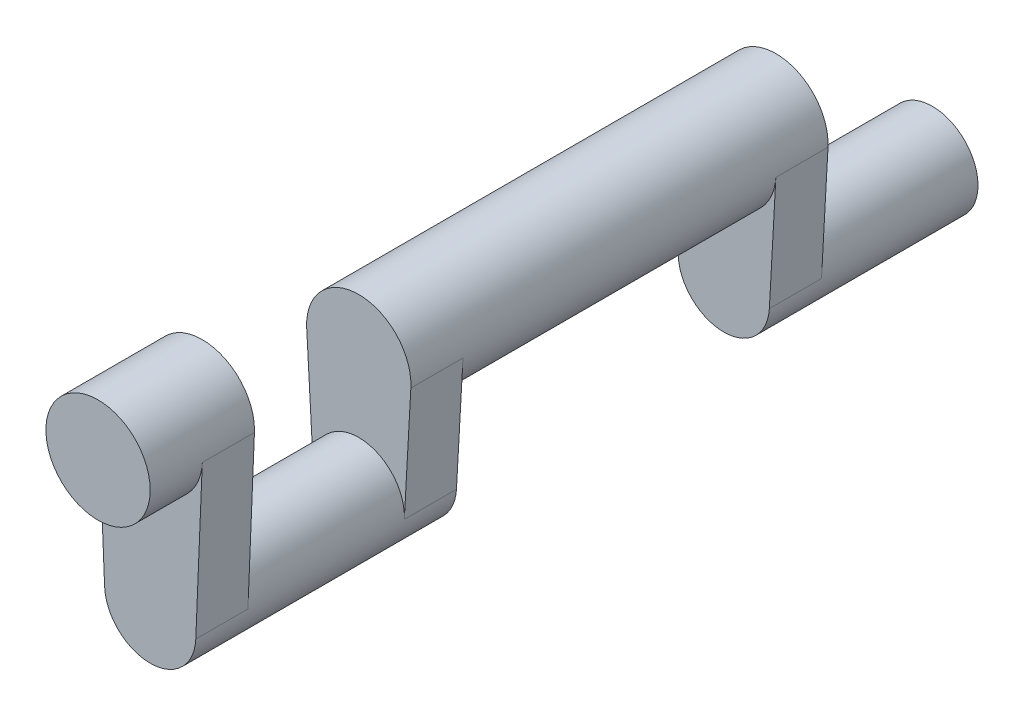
ISO-10303-21;
HEADER;
FILE_DESCRIPTION(('STEP AP214'),'2;1');
FILE_NAME('part.step','',(''),(''),'','','');
FILE_SCHEMA(('AUTOMOTIVE_DESIGN { 1 0 10303 214 1 1 1 1 }'));
ENDSEC;
DATA;
#1=APPLICATION_CONTEXT('core data for automotive mechanical design processes');
#2=APPLICATION_PROTOCOL_DEFINITION('international standard','automotive_design',2000,#1);
#3=PRODUCT_CONTEXT('',#1,'mechanical');
#4=PRODUCT('Part','Part','',(#3));
#5=PRODUCT_RELATED_PRODUCT_CATEGORY('part','',(#4));
#6=PRODUCT_DEFINITION_FORMATION('','',#4);
#7=PRODUCT_DEFINITION_CONTEXT('part definition',#1,'design');
#8=PRODUCT_DEFINITION('design','',#6,#7);
#9=PRODUCT_DEFINITION_SHAPE('','',#8);
#10=(LENGTH_UNIT() NAMED_UNIT(*) SI_UNIT(.MILLI.,.METRE.));
#11=(NAMED_UNIT(*) PLANE_ANGLE_UNIT() SI_UNIT($,.RADIAN.));
#12=(NAMED_UNIT(*) SI_UNIT($,.STERADIAN.) SOLID_ANGLE_UNIT());
#13=UNCERTAINTY_MEASURE_WITH_UNIT(LENGTH_MEASURE(1.E-05),#10,'distance_accuracy_value','');
#14=(GEOMETRIC_REPRESENTATION_CONTEXT(3) GLOBAL_UNCERTAINTY_ASSIGNED_CONTEXT((#13)) GLOBAL_UNIT_ASSIGNED_CONTEXT((#10,
#11,#12)) REPRESENTATION_CONTEXT('',''));
#15=CARTESIAN_POINT('',(0.,0.,0.));
#16=DIRECTION('',(0.,0.,1.));
#17=DIRECTION('',(1.,0.,0.));
#18=AXIS2_PLACEMENT_3D('',#15,#16,#17);
#19=CARTESIAN_POINT('',(0.,-76.2,-152.4));
#20=DIRECTION('',(0.,0.,-1.));
#21=DIRECTION('',(-1.,0.,0.));
#22=AXIS2_PLACEMENT_3D('',#19,#20,#21);
#23=PLANE('',#22);
#24=DIRECTION('',(-0.0555555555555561,0.998455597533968,0.));
#25=VECTOR('',#24,1.);
#26=CARTESIAN_POINT('',(-25.3607721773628,-20.4611111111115,-152.4));
#27=LINE('',#26,#25);
#28=CARTESIAN_POINT('',(-22.1906756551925,-77.4347222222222,-152.4));
#29=VERTEX_POINT('',#28);
#30=CARTESIAN_POINT('',(-25.3607721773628,-20.4611111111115,-152.4));
#31=VERTEX_POINT('',#30);
#32=EDGE_CURVE('E313',#29,#31,#27,.T.);
#33=ORIENTED_EDGE('',*,*,#32,.T.);
#34=CARTESIAN_POINT('',(0.,-19.0500000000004,-152.4));
#35=DIRECTION('',(0.,0.,-1.));
#36=DIRECTION('',(-1.,0.,0.));
#37=AXIS2_PLACEMENT_3D('',#34,#35,#36);
#38=CIRCLE('',#37,25.4000000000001);
#39=CARTESIAN_POINT('',(25.3607721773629,-20.4611111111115,-152.4));
#40=VERTEX_POINT('',#39);
#41=EDGE_CURVE('E156',#31,#40,#38,.F.);
#42=ORIENTED_EDGE('',*,*,#41,.T.);
#43=DIRECTION('',(-0.0555555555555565,-0.998455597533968,0.));
#44=VECTOR('',#43,1.);
#45=CARTESIAN_POINT('',(22.1906756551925,-77.4347222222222,-152.4));
#46=LINE('',#45,#44);
#47=CARTESIAN_POINT('',(22.1906756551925,-77.4347222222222,-152.4));
#48=VERTEX_POINT('',#47);
#49=EDGE_CURVE('E178',#40,#48,#46,.T.);
#50=ORIENTED_EDGE('',*,*,#49,.T.);
#51=CARTESIAN_POINT('',(0.,-76.2,-152.4));
#52=DIRECTION('',(0.,0.,-1.));
#53=DIRECTION('',(-1.,0.,0.));
#54=AXIS2_PLACEMENT_3D('',#51,#52,#53);
#55=CIRCLE('',#54,22.225);
#56=EDGE_CURVE('E184',#48,#29,#55,.T.);
#57=ORIENTED_EDGE('',*,*,#56,.T.);
#58=EDGE_LOOP('',(#33,#42,#50,#57));
#59=FACE_BOUND('',#58,.T.);
#60=ADVANCED_FACE('F31',(#59),#23,.T.);
#61=CARTESIAN_POINT('',(0.,0.,-25.4));
#62=DIRECTION('',(0.,0.,1.));
#63=DIRECTION('',(1.,0.,0.));
#64=AXIS2_PLACEMENT_3D('',#61,#62,#63);
#65=CYLINDRICAL_SURFACE('',#64,25.4);
#66=CARTESIAN_POINT('',(0.,0.,-25.4));
#67=DIRECTION('',(0.,0.,1.));
#68=DIRECTION('',(1.,0.,0.));
#69=AXIS2_PLACEMENT_3D('',#66,#67,#68);
#70=CIRCLE('',#69,25.4);
#71=CARTESIAN_POINT('',(-25.3779418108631,-1.05833333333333,-25.4));
#72=VERTEX_POINT('',#71);
#73=CARTESIAN_POINT('',(25.3779418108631,-1.05833333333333,-25.4));
#74=VERTEX_POINT('',#73);
#75=EDGE_CURVE('E204',#72,#74,#70,.T.);
#76=ORIENTED_EDGE('',*,*,#75,.T.);
#77=DIRECTION('',(0.,0.,1.));
#78=VECTOR('',#77,1.);
#79=CARTESIAN_POINT('',(25.3779418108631,-1.05833333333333,-50.8));
#80=LINE('',#79,#78);
#81=CARTESIAN_POINT('',(25.3779418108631,-1.05833333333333,-50.8));
#82=VERTEX_POINT('',#81);
#83=EDGE_CURVE('E214',#82,#74,#80,.T.);
#84=ORIENTED_EDGE('',*,*,#83,.F.);
#85=CARTESIAN_POINT('',(0.,0.,-50.8));
#86=DIRECTION('',(0.,0.,-1.));
#87=DIRECTION('',(-1.,0.,0.));
#88=AXIS2_PLACEMENT_3D('',#85,#86,#87);
#89=CIRCLE('',#88,25.4);
#90=CARTESIAN_POINT('',(-25.3779418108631,-1.05833333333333,-50.8));
#91=VERTEX_POINT('',#90);
#92=EDGE_CURVE('E217',#91,#82,#89,.T.);
#93=ORIENTED_EDGE('',*,*,#92,.F.);
#94=DIRECTION('',(0.,0.,1.));
#95=VECTOR('',#94,1.);
#96=CARTESIAN_POINT('',(-25.3779418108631,-1.05833333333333,-50.8));
#97=LINE('',#96,#95);
#98=EDGE_CURVE('E193',#91,#72,#97,.T.);
#99=ORIENTED_EDGE('',*,*,#98,.T.);
#100=EDGE_LOOP('',(#76,#84,#93,#99));
#101=FACE_BOUND('',#100,.T.);
#102=CARTESIAN_POINT('',(0.,0.,0.));
#103=DIRECTION('',(0.,0.,1.));
#104=DIRECTION('',(1.,0.,0.));
#105=AXIS2_PLACEMENT_3D('',#102,#103,#104);
#106=CIRCLE('',#105,25.4);
#107=CARTESIAN_POINT('',(25.4,0.,0.));
#108=VERTEX_POINT('',#107);
#109=EDGE_CURVE('E231',#108,#108,#106,.T.);
#110=ORIENTED_EDGE('',*,*,#109,.F.);
#111=EDGE_LOOP('',(#110));
#112=FACE_BOUND('',#111,.T.);
#113=ADVANCED_FACE('F33',(#101,#112),#65,.T.);
#114=CARTESIAN_POINT('',(0.,0.,0.));
#115=DIRECTION('',(0.,0.,1.));
#116=DIRECTION('',(1.,0.,0.));
#117=AXIS2_PLACEMENT_3D('',#114,#115,#116);
#118=PLANE('',#117);
#119=ORIENTED_EDGE('',*,*,#109,.T.);
#120=EDGE_LOOP('',(#119));
#121=FACE_BOUND('',#120,.T.);
#122=ADVANCED_FACE('F280',(#121),#118,.T.);
#123=CARTESIAN_POINT('',(25.3779418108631,-1.05833333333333,-50.8));
#124=DIRECTION('',(-0.999131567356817,0.0416666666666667,0.));
#125=DIRECTION('',(-0.0416666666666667,-0.999131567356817,0.));
#126=AXIS2_PLACEMENT_3D('',#123,#124,#125);
#127=PLANE('',#126);
#128=DIRECTION('',(-0.0416666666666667,-0.999131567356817,0.));
#129=VECTOR('',#128,1.);
#130=CARTESIAN_POINT('',(25.3779418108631,-1.05833333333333,-25.4));
#131=LINE('',#130,#129);
#132=CARTESIAN_POINT('',(22.2056990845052,-77.1260416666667,-25.4));
#133=VERTEX_POINT('',#132);
#134=EDGE_CURVE('E186',#74,#133,#131,.T.);
#135=ORIENTED_EDGE('',*,*,#134,.T.);
#136=DIRECTION('',(0.,0.,1.));
#137=VECTOR('',#136,1.);
#138=CARTESIAN_POINT('',(22.2056990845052,-77.1260416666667,-50.8));
#139=LINE('',#138,#137);
#140=CARTESIAN_POINT('',(22.2056990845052,-77.1260416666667,-50.8));
#141=VERTEX_POINT('',#140);
#142=EDGE_CURVE('E200',#141,#133,#139,.T.);
#143=ORIENTED_EDGE('',*,*,#142,.F.);
#144=DIRECTION('',(-0.0416666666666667,-0.999131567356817,0.));
#145=VECTOR('',#144,1.);
#146=CARTESIAN_POINT('',(25.3779418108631,-1.05833333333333,-50.8));
#147=LINE('',#146,#145);
#148=EDGE_CURVE('E194',#82,#141,#147,.T.);
#149=ORIENTED_EDGE('',*,*,#148,.F.);
#150=ORIENTED_EDGE('',*,*,#83,.T.);
#151=EDGE_LOOP('',(#135,#143,#149,#150));
#152=FACE_BOUND('',#151,.T.);
#153=ADVANCED_FACE('F247',(#152),#127,.F.);
#154=CARTESIAN_POINT('',(0.,-76.2,-50.8));
#155=DIRECTION('',(0.,0.,1.));
#156=DIRECTION('',(1.,0.,0.));
#157=AXIS2_PLACEMENT_3D('',#154,#155,#156);
#158=CYLINDRICAL_SURFACE('',#157,22.225);
#159=CARTESIAN_POINT('',(0.,-76.2,-25.4));
#160=DIRECTION('',(0.,0.,-1.));
#161=DIRECTION('',(-1.,0.,0.));
#162=AXIS2_PLACEMENT_3D('',#159,#160,#161);
#163=CIRCLE('',#162,22.225);
#164=CARTESIAN_POINT('',(-22.2056990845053,-77.1260416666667,-25.4));
#165=VERTEX_POINT('',#164);
#166=EDGE_CURVE('E225',#133,#165,#163,.T.);
#167=ORIENTED_EDGE('',*,*,#166,.T.);
#168=DIRECTION('',(0.,0.,1.));
#169=VECTOR('',#168,1.);
#170=CARTESIAN_POINT('',(-22.2056990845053,-77.1260416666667,-50.8));
#171=LINE('',#170,#169);
#172=CARTESIAN_POINT('',(-22.2056990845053,-77.1260416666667,-50.8));
#173=VERTEX_POINT('',#172);
#174=EDGE_CURVE('E197',#173,#165,#171,.T.);
#175=ORIENTED_EDGE('',*,*,#174,.F.);
#176=CARTESIAN_POINT('',(0.,-76.2,-50.8));
#177=DIRECTION('',(0.,0.,-1.));
#178=DIRECTION('',(-1.,0.,0.));
#179=AXIS2_PLACEMENT_3D('',#176,#177,#178);
#180=CIRCLE('',#179,22.225);
#181=EDGE_CURVE('E159',#173,#141,#180,.T.);
#182=ORIENTED_EDGE('',*,*,#181,.T.);
#183=ORIENTED_EDGE('',*,*,#142,.T.);
#184=EDGE_LOOP('',(#167,#175,#182,#183));
#185=FACE_BOUND('',#184,.T.);
#186=CARTESIAN_POINT('',(0.,-76.2,-127.));
#187=DIRECTION('',(0.,0.,-1.));
#188=DIRECTION('',(-1.,0.,0.));
#189=AXIS2_PLACEMENT_3D('',#186,#187,#188);
#190=CIRCLE('',#189,22.225);
#191=CARTESIAN_POINT('',(-22.1906756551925,-77.4347222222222,-127.));
#192=VERTEX_POINT('',#191);
#193=CARTESIAN_POINT('',(22.1906756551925,-77.4347222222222,-127.));
#194=VERTEX_POINT('',#193);
#195=EDGE_CURVE('E165',#192,#194,#190,.T.);
#196=ORIENTED_EDGE('',*,*,#195,.F.);
#197=DIRECTION('',(0.,0.,1.));
#198=VECTOR('',#197,1.);
#199=CARTESIAN_POINT('',(-22.1906756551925,-77.4347222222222,-152.4));
#200=LINE('',#199,#198);
#201=EDGE_CURVE('E162',#29,#192,#200,.T.);
#202=ORIENTED_EDGE('',*,*,#201,.F.);
#203=ORIENTED_EDGE('',*,*,#56,.F.);
#204=DIRECTION('',(0.,0.,1.));
#205=VECTOR('',#204,1.);
#206=CARTESIAN_POINT('',(22.1906756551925,-77.4347222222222,-152.4));
#207=LINE('',#206,#205);
#208=EDGE_CURVE('E174',#48,#194,#207,.T.);
#209=ORIENTED_EDGE('',*,*,#208,.T.);
#210=EDGE_LOOP('',(#196,#202,#203,#209));
#211=FACE_BOUND('',#210,.T.);
#212=ADVANCED_FACE('F258',(#185,#211),#158,.T.);
#213=CARTESIAN_POINT('',(-22.2056990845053,-77.1260416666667,-50.8));
#214=DIRECTION('',(0.999131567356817,0.0416666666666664,0.));
#215=DIRECTION('',(-0.0416666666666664,0.999131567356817,0.));
#216=AXIS2_PLACEMENT_3D('',#213,#214,#215);
#217=PLANE('',#216);
#218=DIRECTION('',(-0.0416666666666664,0.999131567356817,0.));
#219=VECTOR('',#218,1.);
#220=CARTESIAN_POINT('',(-22.2056990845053,-77.1260416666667,-25.4));
#221=LINE('',#220,#219);
#222=EDGE_CURVE('E220',#165,#72,#221,.T.);
#223=ORIENTED_EDGE('',*,*,#222,.T.);
#224=ORIENTED_EDGE('',*,*,#98,.F.);
#225=DIRECTION('',(-0.0416666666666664,0.999131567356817,0.));
#226=VECTOR('',#225,1.);
#227=CARTESIAN_POINT('',(-22.2056990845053,-77.1260416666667,-50.8));
#228=LINE('',#227,#226);
#229=EDGE_CURVE('E191',#173,#91,#228,.T.);
#230=ORIENTED_EDGE('',*,*,#229,.F.);
#231=ORIENTED_EDGE('',*,*,#174,.T.);
#232=EDGE_LOOP('',(#223,#224,#230,#231));
#233=FACE_BOUND('',#232,.T.);
#234=ADVANCED_FACE('F262',(#233),#217,.F.);
#235=CARTESIAN_POINT('',(0.,0.,-50.8));
#236=DIRECTION('',(0.,0.,-1.));
#237=DIRECTION('',(-1.,0.,0.));
#238=AXIS2_PLACEMENT_3D('',#235,#236,#237);
#239=PLANE('',#238);
#240=ORIENTED_EDGE('',*,*,#181,.F.);
#241=ORIENTED_EDGE('',*,*,#229,.T.);
#242=ORIENTED_EDGE('',*,*,#92,.T.);
#243=ORIENTED_EDGE('',*,*,#148,.T.);
#244=EDGE_LOOP('',(#240,#241,#242,#243));
#245=FACE_BOUND('',#244,.T.);
#246=ADVANCED_FACE('F263',(#245),#239,.T.);
#247=CARTESIAN_POINT('',(0.,0.,-25.4));
#248=DIRECTION('',(0.,0.,-1.));
#249=DIRECTION('',(-1.,0.,0.));
#250=AXIS2_PLACEMENT_3D('',#247,#248,#249);
#251=PLANE('',#250);
#252=ORIENTED_EDGE('',*,*,#75,.F.);
#253=ORIENTED_EDGE('',*,*,#222,.F.);
#254=ORIENTED_EDGE('',*,*,#166,.F.);
#255=ORIENTED_EDGE('',*,*,#134,.F.);
#256=EDGE_LOOP('',(#252,#253,#254,#255));
#257=FACE_BOUND('',#256,.T.);
#258=ADVANCED_FACE('F254',(#257),#251,.F.);
#259=CARTESIAN_POINT('',(0.,-76.2,-127.));
#260=DIRECTION('',(0.,0.,-1.));
#261=DIRECTION('',(-1.,0.,0.));
#262=AXIS2_PLACEMENT_3D('',#259,#260,#261);
#263=PLANE('',#262);
#264=CARTESIAN_POINT('',(0.,-19.0500000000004,-127.));
#265=DIRECTION('',(0.,0.,-1.));
#266=DIRECTION('',(1.,0.,0.));
#267=AXIS2_PLACEMENT_3D('',#264,#265,#266);
#268=CIRCLE('',#267,25.4);
#269=CARTESIAN_POINT('',(-25.3607721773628,-20.4611111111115,-127.));
#270=VERTEX_POINT('',#269);
#271=CARTESIAN_POINT('',(25.3607721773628,-20.4611111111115,-127.));
#272=VERTEX_POINT('',#271);
#273=EDGE_CURVE('E171',#270,#272,#268,.T.);
#274=ORIENTED_EDGE('',*,*,#273,.F.);
#275=DIRECTION('',(-0.0555555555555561,0.998455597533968,0.));
#276=VECTOR('',#275,1.);
#277=CARTESIAN_POINT('',(-25.3607721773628,-20.4611111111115,-127.));
#278=LINE('',#277,#276);
#279=EDGE_CURVE('E169',#192,#270,#278,.T.);
#280=ORIENTED_EDGE('',*,*,#279,.F.);
#281=ORIENTED_EDGE('',*,*,#195,.T.);
#282=DIRECTION('',(-0.0555555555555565,-0.998455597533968,0.));
#283=VECTOR('',#282,1.);
#284=CARTESIAN_POINT('',(22.1906756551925,-77.4347222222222,-127.));
#285=LINE('',#284,#283);
#286=EDGE_CURVE('E181',#272,#194,#285,.T.);
#287=ORIENTED_EDGE('',*,*,#286,.F.);
#288=EDGE_LOOP('',(#274,#280,#281,#287));
#289=FACE_BOUND('',#288,.T.);
#290=ADVANCED_FACE('F270',(#289),#263,.F.);
#291=CARTESIAN_POINT('',(-25.3607721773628,-20.4611111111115,-152.4));
#292=DIRECTION('',(0.998455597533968,0.055555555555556,0.));
#293=DIRECTION('',(-0.0555555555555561,0.998455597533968,0.));
#294=AXIS2_PLACEMENT_3D('',#291,#292,#293);
#295=PLANE('',#294);
#296=ORIENTED_EDGE('',*,*,#279,.T.);
#297=DIRECTION('',(0.,0.,1.));
#298=VECTOR('',#297,1.);
#299=CARTESIAN_POINT('',(-25.3607721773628,-20.4611111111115,-152.4));
#300=LINE('',#299,#298);
#301=EDGE_CURVE('E166',#31,#270,#300,.T.);
#302=ORIENTED_EDGE('',*,*,#301,.F.);
#303=ORIENTED_EDGE('',*,*,#32,.F.);
#304=ORIENTED_EDGE('',*,*,#201,.T.);
#305=EDGE_LOOP('',(#296,#302,#303,#304));
#306=FACE_BOUND('',#305,.T.);
#307=ADVANCED_FACE('F286',(#306),#295,.F.);
#308=CARTESIAN_POINT('',(0.,-19.0500000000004,-152.4));
#309=DIRECTION('',(0.,0.,1.));
#310=DIRECTION('',(1.,0.,0.));
#311=AXIS2_PLACEMENT_3D('',#308,#309,#310);
#312=CYLINDRICAL_SURFACE('',#311,25.4);
#313=CARTESIAN_POINT('',(0.,-19.0500000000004,-330.2));
#314=DIRECTION('',(0.,0.,1.));
#315=DIRECTION('',(1.,0.,0.));
#316=AXIS2_PLACEMENT_3D('',#313,#314,#315);
#317=CIRCLE('',#316,25.4000000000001);
#318=CARTESIAN_POINT('',(25.3607721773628,-20.4611111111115,-330.2));
#319=VERTEX_POINT('',#318);
#320=CARTESIAN_POINT('',(-25.3607721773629,-20.4611111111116,-330.2));
#321=VERTEX_POINT('',#320);
#322=EDGE_CURVE('E139',#319,#321,#317,.T.);
#323=ORIENTED_EDGE('',*,*,#322,.T.);
#324=DIRECTION('',(0.,0.,-1.));
#325=VECTOR('',#324,1.);
#326=CARTESIAN_POINT('',(-25.3607721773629,-20.4611111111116,-304.8));
#327=LINE('',#326,#325);
#328=CARTESIAN_POINT('',(-25.3607721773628,-20.4611111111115,-304.8));
#329=VERTEX_POINT('',#328);
#330=EDGE_CURVE('E52',#329,#321,#327,.T.);
#331=ORIENTED_EDGE('',*,*,#330,.F.);
#332=CARTESIAN_POINT('',(0.,-19.0500000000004,-304.8));
#333=DIRECTION('',(0.,0.,-1.));
#334=DIRECTION('',(-1.,0.,0.));
#335=AXIS2_PLACEMENT_3D('',#332,#333,#334);
#336=CIRCLE('',#335,25.4);
#337=CARTESIAN_POINT('',(25.3607721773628,-20.4611111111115,-304.8));
#338=VERTEX_POINT('',#337);
#339=EDGE_CURVE('E40',#338,#329,#336,.T.);
#340=ORIENTED_EDGE('',*,*,#339,.F.);
#341=DIRECTION('',(0.,0.,-1.));
#342=VECTOR('',#341,1.);
#343=CARTESIAN_POINT('',(25.3607721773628,-20.4611111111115,-304.8));
#344=LINE('',#343,#342);
#345=EDGE_CURVE('E136',#338,#319,#344,.T.);
#346=ORIENTED_EDGE('',*,*,#345,.T.);
#347=EDGE_LOOP('',(#323,#331,#340,#346));
#348=FACE_BOUND('',#347,.T.);
#349=ORIENTED_EDGE('',*,*,#273,.T.);
#350=DIRECTION('',(0.,0.,1.));
#351=VECTOR('',#350,1.);
#352=CARTESIAN_POINT('',(25.3607721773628,-20.4611111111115,-152.4));
#353=LINE('',#352,#351);
#354=EDGE_CURVE('E177',#40,#272,#353,.T.);
#355=ORIENTED_EDGE('',*,*,#354,.F.);
#356=ORIENTED_EDGE('',*,*,#41,.F.);
#357=ORIENTED_EDGE('',*,*,#301,.T.);
#358=EDGE_LOOP('',(#349,#355,#356,#357));
#359=FACE_BOUND('',#358,.T.);
#360=ADVANCED_FACE('F291',(#348,#359),#312,.T.);
#361=CARTESIAN_POINT('',(22.1906756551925,-77.4347222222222,-152.4));
#362=DIRECTION('',(-0.998455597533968,0.0555555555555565,0.));
#363=DIRECTION('',(-0.0555555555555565,-0.998455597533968,0.));
#364=AXIS2_PLACEMENT_3D('',#361,#362,#363);
#365=PLANE('',#364);
#366=ORIENTED_EDGE('',*,*,#286,.T.);
#367=ORIENTED_EDGE('',*,*,#208,.F.);
#368=ORIENTED_EDGE('',*,*,#49,.F.);
#369=ORIENTED_EDGE('',*,*,#354,.T.);
#370=EDGE_LOOP('',(#366,#367,#368,#369));
#371=FACE_BOUND('',#370,.T.);
#372=ADVANCED_FACE('F288',(#371),#365,.F.);
#373=CARTESIAN_POINT('',(-17.9538922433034,-63.1000618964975,-330.2));
#374=DIRECTION('',(0.,0.,1.));
#375=DIRECTION('',(-0.807824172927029,0.589423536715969,0.));
#376=AXIS2_PLACEMENT_3D('',#373,#374,#375);
#377=PLANE('',#376);
#378=DIRECTION('',(-0.0555555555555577,-0.998455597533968,0.));
#379=VECTOR('',#378,1.);
#380=CARTESIAN_POINT('',(22.1906756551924,-77.4347222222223,-330.2));
#381=LINE('',#380,#379);
#382=CARTESIAN_POINT('',(22.1906756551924,-77.4347222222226,-330.2));
#383=VERTEX_POINT('',#382);
#384=EDGE_CURVE('E133',#319,#383,#381,.T.);
#385=ORIENTED_EDGE('',*,*,#384,.T.);
#386=CARTESIAN_POINT('',(0.,-76.2000000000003,-330.2));
#387=DIRECTION('',(0.,0.,1.));
#388=DIRECTION('',(1.,0.,0.));
#389=AXIS2_PLACEMENT_3D('',#386,#387,#388);
#390=CIRCLE('',#389,22.225);
#391=CARTESIAN_POINT('',(-22.1906756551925,-77.4347222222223,-330.2));
#392=VERTEX_POINT('',#391);
#393=EDGE_CURVE('E11',#383,#392,#390,.T.);
#394=ORIENTED_EDGE('',*,*,#393,.T.);
#395=DIRECTION('',(-0.0555555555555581,0.998455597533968,0.));
#396=VECTOR('',#395,1.);
#397=CARTESIAN_POINT('',(-25.3607721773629,-20.4611111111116,-330.2));
#398=LINE('',#397,#396);
#399=EDGE_CURVE('E140',#392,#321,#398,.T.);
#400=ORIENTED_EDGE('',*,*,#399,.T.);
#401=ORIENTED_EDGE('',*,*,#322,.F.);
#402=EDGE_LOOP('',(#385,#394,#400,#401));
#403=FACE_BOUND('',#402,.T.);
#404=ADVANCED_FACE('F138',(#403),#377,.F.);
#405=CARTESIAN_POINT('',(0.,-19.0500000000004,-304.8));
#406=DIRECTION('',(0.,0.,-1.));
#407=DIRECTION('',(-1.,0.,0.));
#408=AXIS2_PLACEMENT_3D('',#405,#406,#407);
#409=PLANE('',#408);
#410=DIRECTION('',(-0.0555555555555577,-0.998455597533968,0.));
#411=VECTOR('',#410,1.);
#412=CARTESIAN_POINT('',(22.1906756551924,-77.4347222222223,-304.8));
#413=LINE('',#412,#411);
#414=CARTESIAN_POINT('',(22.1906756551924,-77.4347222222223,-304.8));
#415=VERTEX_POINT('',#414);
#416=EDGE_CURVE('E135',#338,#415,#413,.T.);
#417=ORIENTED_EDGE('',*,*,#416,.F.);
#418=ORIENTED_EDGE('',*,*,#339,.T.);
#419=DIRECTION('',(-0.0555555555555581,0.998455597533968,0.));
#420=VECTOR('',#419,1.);
#421=CARTESIAN_POINT('',(-25.3607721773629,-20.4611111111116,-304.8));
#422=LINE('',#421,#420);
#423=CARTESIAN_POINT('',(-22.1906756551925,-77.4347222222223,-304.8));
#424=VERTEX_POINT('',#423);
#425=EDGE_CURVE('E319',#424,#329,#422,.T.);
#426=ORIENTED_EDGE('',*,*,#425,.F.);
#427=CARTESIAN_POINT('',(0.,-76.2000000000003,-304.8));
#428=DIRECTION('',(0.,0.,-1.));
#429=DIRECTION('',(1.,0.,0.));
#430=AXIS2_PLACEMENT_3D('',#427,#428,#429);
#431=CIRCLE('',#430,22.225);
#432=EDGE_CURVE('E323',#415,#424,#431,.T.);
#433=ORIENTED_EDGE('',*,*,#432,.F.);
#434=EDGE_LOOP('',(#417,#418,#426,#433));
#435=FACE_BOUND('',#434,.T.);
#436=ADVANCED_FACE('F327',(#435),#409,.F.);
#437=CARTESIAN_POINT('',(-25.3607721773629,-20.4611111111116,-304.8));
#438=DIRECTION('',(-0.998455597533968,-0.0555555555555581,0.));
#439=DIRECTION('',(0.0555555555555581,-0.998455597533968,0.));
#440=AXIS2_PLACEMENT_3D('',#437,#438,#439);
#441=PLANE('',#440);
#442=ORIENTED_EDGE('',*,*,#399,.F.);
#443=DIRECTION('',(0.,0.,-1.));
#444=VECTOR('',#443,1.);
#445=CARTESIAN_POINT('',(-22.1906756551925,-77.4347222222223,-304.8));
#446=LINE('',#445,#444);
#447=EDGE_CURVE('E124',#424,#392,#446,.T.);
#448=ORIENTED_EDGE('',*,*,#447,.F.);
#449=ORIENTED_EDGE('',*,*,#425,.T.);
#450=ORIENTED_EDGE('',*,*,#330,.T.);
#451=EDGE_LOOP('',(#442,#448,#449,#450));
#452=FACE_BOUND('',#451,.T.);
#453=ADVANCED_FACE('F329',(#452),#441,.T.);
#454=CARTESIAN_POINT('',(0.,-76.2000000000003,-304.8));
#455=DIRECTION('',(0.,0.,-1.));
#456=DIRECTION('',(-1.,0.,0.));
#457=AXIS2_PLACEMENT_3D('',#454,#455,#456);
#458=CYLINDRICAL_SURFACE('',#457,22.225);
#459=ORIENTED_EDGE('',*,*,#447,.T.);
#460=ORIENTED_EDGE('',*,*,#393,.F.);
#461=DIRECTION('',(0.,0.,-1.));
#462=VECTOR('',#461,1.);
#463=CARTESIAN_POINT('',(22.1906756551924,-77.4347222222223,-304.8));
#464=LINE('',#463,#462);
#465=EDGE_CURVE('E122',#415,#383,#464,.T.);
#466=ORIENTED_EDGE('',*,*,#465,.F.);
#467=ORIENTED_EDGE('',*,*,#432,.T.);
#468=EDGE_LOOP('',(#459,#460,#466,#467));
#469=FACE_BOUND('',#468,.T.);
#470=CARTESIAN_POINT('',(0.,-76.2000000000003,-406.4));
#471=DIRECTION('',(0.,0.,1.));
#472=DIRECTION('',(1.,0.,0.));
#473=AXIS2_PLACEMENT_3D('',#470,#471,#472);
#474=CIRCLE('',#473,22.225);
#475=CARTESIAN_POINT('',(22.225,-76.2000000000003,-406.4));
#476=VERTEX_POINT('',#475);
#477=EDGE_CURVE('E141',#476,#476,#474,.T.);
#478=ORIENTED_EDGE('',*,*,#477,.T.);
#479=EDGE_LOOP('',(#478));
#480=FACE_BOUND('',#479,.T.);
#481=ADVANCED_FACE('F119',(#469,#480),#458,.T.);
#482=CARTESIAN_POINT('',(22.1906756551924,-77.4347222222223,-304.8));
#483=DIRECTION('',(0.998455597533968,-0.0555555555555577,0.));
#484=DIRECTION('',(0.0555555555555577,0.998455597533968,0.));
#485=AXIS2_PLACEMENT_3D('',#482,#483,#484);
#486=PLANE('',#485);
#487=ORIENTED_EDGE('',*,*,#384,.F.);
#488=ORIENTED_EDGE('',*,*,#345,.F.);
#489=ORIENTED_EDGE('',*,*,#416,.T.);
#490=ORIENTED_EDGE('',*,*,#465,.T.);
#491=EDGE_LOOP('',(#487,#488,#489,#490));
#492=FACE_BOUND('',#491,.T.);
#493=ADVANCED_FACE('F132',(#492),#486,.T.);
#494=CARTESIAN_POINT('',(0.,-76.2000000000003,-406.4));
#495=DIRECTION('',(0.,0.,1.));
#496=DIRECTION('',(1.,0.,0.));
#497=AXIS2_PLACEMENT_3D('',#494,#495,#496);
#498=PLANE('',#497);
#499=ORIENTED_EDGE('',*,*,#477,.F.);
#500=EDGE_LOOP('',(#499));
#501=FACE_BOUND('',#500,.T.);
#502=ADVANCED_FACE('F340',(#501),#498,.F.);
#503=CLOSED_SHELL('',(#60,#113,#122,#153,#212,#234,#246,#258,#290,#307,#360,#372,#404,#436,#453,
#481,#493,#502));
#504=MANIFOLD_SOLID_BREP('B2',#503);
#505=ADVANCED_BREP_SHAPE_REPRESENTATION('',(#18,#504),#14);
#506=SHAPE_DEFINITION_REPRESENTATION(#9,#505);
ENDSEC;
END-ISO-10303-21;
